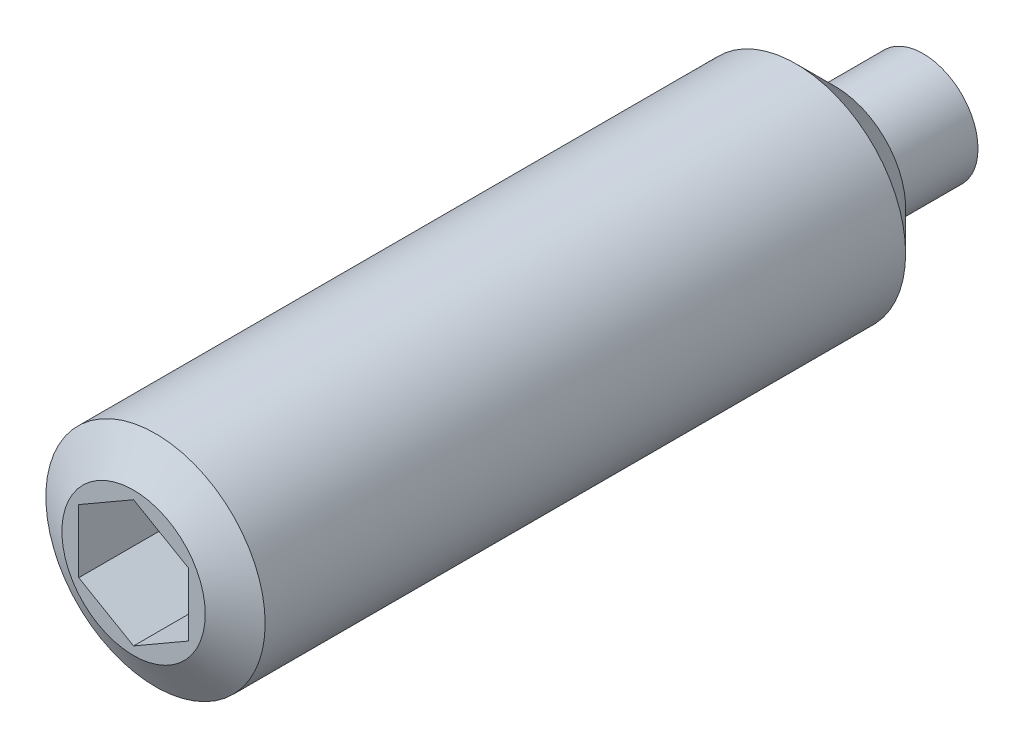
ISO-10303-21;
HEADER;
FILE_DESCRIPTION(('STEP AP214'),'2;1');
FILE_NAME('part.step','',(''),(''),'','','');
FILE_SCHEMA(('AUTOMOTIVE_DESIGN { 1 0 10303 214 1 1 1 1 }'));
ENDSEC;
DATA;
#1=APPLICATION_CONTEXT('core data for automotive mechanical design processes');
#2=APPLICATION_PROTOCOL_DEFINITION('international standard','automotive_design',2000,#1);
#3=PRODUCT_CONTEXT('',#1,'mechanical');
#4=PRODUCT('Part','Part','',(#3));
#5=PRODUCT_RELATED_PRODUCT_CATEGORY('part','',(#4));
#6=PRODUCT_DEFINITION_FORMATION('','',#4);
#7=PRODUCT_DEFINITION_CONTEXT('part definition',#1,'design');
#8=PRODUCT_DEFINITION('design','',#6,#7);
#9=PRODUCT_DEFINITION_SHAPE('','',#8);
#10=(LENGTH_UNIT() NAMED_UNIT(*) SI_UNIT(.MILLI.,.METRE.));
#11=(NAMED_UNIT(*) PLANE_ANGLE_UNIT() SI_UNIT($,.RADIAN.));
#12=(NAMED_UNIT(*) SI_UNIT($,.STERADIAN.) SOLID_ANGLE_UNIT());
#13=UNCERTAINTY_MEASURE_WITH_UNIT(LENGTH_MEASURE(1.E-05),#10,'distance_accuracy_value','');
#14=(GEOMETRIC_REPRESENTATION_CONTEXT(3) GLOBAL_UNCERTAINTY_ASSIGNED_CONTEXT((#13)) GLOBAL_UNIT_ASSIGNED_CONTEXT((#10,
#11,#12)) REPRESENTATION_CONTEXT('',''));
#15=CARTESIAN_POINT('',(0.,0.,0.));
#16=DIRECTION('',(0.,0.,1.));
#17=DIRECTION('',(1.,0.,0.));
#18=AXIS2_PLACEMENT_3D('',#15,#16,#17);
#19=CARTESIAN_POINT('',(0.,0.,38.));
#20=DIRECTION('',(0.,0.,1.));
#21=DIRECTION('',(1.,0.,0.));
#22=AXIS2_PLACEMENT_3D('',#19,#20,#21);
#23=CYLINDRICAL_SURFACE('',#22,2.5);
#24=CARTESIAN_POINT('',(0.,0.,17.5));
#25=DIRECTION('',(0.,0.,1.));
#26=DIRECTION('',(1.,0.,0.));
#27=AXIS2_PLACEMENT_3D('',#24,#25,#26);
#28=CIRCLE('',#27,2.5);
#29=CARTESIAN_POINT('',(2.5,0.,17.5));
#30=VERTEX_POINT('',#29);
#31=EDGE_CURVE('E9',#30,#30,#28,.F.);
#32=ORIENTED_EDGE('',*,*,#31,.T.);
#33=EDGE_LOOP('',(#32));
#34=FACE_BOUND('',#33,.T.);
#35=CARTESIAN_POINT('',(0.,0.,2.9));
#36=DIRECTION('',(0.,0.,-1.));
#37=DIRECTION('',(-1.,0.,0.));
#38=AXIS2_PLACEMENT_3D('',#35,#36,#37);
#39=CIRCLE('',#38,2.5);
#40=CARTESIAN_POINT('',(-2.5,0.,2.9));
#41=VERTEX_POINT('',#40);
#42=EDGE_CURVE('E127',#41,#41,#39,.F.);
#43=ORIENTED_EDGE('',*,*,#42,.T.);
#44=EDGE_LOOP('',(#43));
#45=FACE_BOUND('',#44,.T.);
#46=ADVANCED_FACE('F14',(#34,#45),#23,.T.);
#47=CARTESIAN_POINT('',(2.5,0.,2.));
#48=DIRECTION('',(0.,0.,-1.));
#49=DIRECTION('',(-1.,0.,0.));
#50=AXIS2_PLACEMENT_3D('',#47,#48,#49);
#51=PLANE('',#50);
#52=CARTESIAN_POINT('',(0.,0.,2.));
#53=DIRECTION('',(0.,0.,-1.));
#54=DIRECTION('',(-1.,0.,0.));
#55=AXIS2_PLACEMENT_3D('',#52,#53,#54);
#56=CIRCLE('',#55,1.6);
#57=CARTESIAN_POINT('',(-1.6,0.,2.));
#58=VERTEX_POINT('',#57);
#59=EDGE_CURVE('E130',#58,#58,#56,.T.);
#60=ORIENTED_EDGE('',*,*,#59,.T.);
#61=EDGE_LOOP('',(#60));
#62=FACE_BOUND('',#61,.T.);
#63=CARTESIAN_POINT('',(0.,0.,2.));
#64=DIRECTION('',(0.,0.,1.));
#65=DIRECTION('',(1.,0.,0.));
#66=AXIS2_PLACEMENT_3D('',#63,#64,#65);
#67=CIRCLE('',#66,1.25);
#68=CARTESIAN_POINT('',(1.25,0.,2.));
#69=VERTEX_POINT('',#68);
#70=EDGE_CURVE('E124',#69,#69,#67,.T.);
#71=ORIENTED_EDGE('',*,*,#70,.T.);
#72=EDGE_LOOP('',(#71));
#73=FACE_BOUND('',#72,.T.);
#74=ADVANCED_FACE('F146',(#62,#73),#51,.T.);
#75=CARTESIAN_POINT('',(0.,0.,38.));
#76=DIRECTION('',(0.,0.,1.));
#77=DIRECTION('',(1.,0.,0.));
#78=AXIS2_PLACEMENT_3D('',#75,#76,#77);
#79=CYLINDRICAL_SURFACE('',#78,1.25);
#80=ORIENTED_EDGE('',*,*,#70,.F.);
#81=EDGE_LOOP('',(#80));
#82=FACE_BOUND('',#81,.T.);
#83=CARTESIAN_POINT('',(0.,0.,0.));
#84=DIRECTION('',(0.,0.,1.));
#85=DIRECTION('',(1.,0.,0.));
#86=AXIS2_PLACEMENT_3D('',#83,#84,#85);
#87=CIRCLE('',#86,1.25);
#88=CARTESIAN_POINT('',(1.25,0.,0.));
#89=VERTEX_POINT('',#88);
#90=EDGE_CURVE('E121',#89,#89,#87,.T.);
#91=ORIENTED_EDGE('',*,*,#90,.T.);
#92=EDGE_LOOP('',(#91));
#93=FACE_BOUND('',#92,.T.);
#94=ADVANCED_FACE('F153',(#82,#93),#79,.T.);
#95=CARTESIAN_POINT('',(1.25,0.,0.));
#96=DIRECTION('',(0.,0.,-1.));
#97=DIRECTION('',(-1.,0.,0.));
#98=AXIS2_PLACEMENT_3D('',#95,#96,#97);
#99=PLANE('',#98);
#100=ORIENTED_EDGE('',*,*,#90,.F.);
#101=EDGE_LOOP('',(#100));
#102=FACE_BOUND('',#101,.T.);
#103=ADVANCED_FACE('F160',(#102),#99,.T.);
#104=CARTESIAN_POINT('',(0.,0.,2.9));
#105=DIRECTION('',(0.,0.,1.));
#106=DIRECTION('',(1.,0.,0.));
#107=AXIS2_PLACEMENT_3D('',#104,#105,#106);
#108=CONICAL_SURFACE('',#107,2.5,0.785398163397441);
#109=ORIENTED_EDGE('',*,*,#59,.F.);
#110=EDGE_LOOP('',(#109));
#111=FACE_BOUND('',#110,.T.);
#112=ORIENTED_EDGE('',*,*,#42,.F.);
#113=EDGE_LOOP('',(#112));
#114=FACE_BOUND('',#113,.T.);
#115=ADVANCED_FACE('F164',(#111,#114),#108,.T.);
#116=CARTESIAN_POINT('',(1.25,-2.16506350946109,15.5));
#117=DIRECTION('',(0.,0.,-1.));
#118=DIRECTION('',(-1.,0.,0.));
#119=AXIS2_PLACEMENT_3D('',#116,#117,#118);
#120=PLANE('',#119);
#121=DIRECTION('',(0.86602540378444,-0.5,0.));
#122=VECTOR('',#121,1.);
#123=CARTESIAN_POINT('',(-1.25,-0.721687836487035,15.5));
#124=LINE('',#123,#122);
#125=CARTESIAN_POINT('',(-1.25,-0.721687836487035,15.5));
#126=VERTEX_POINT('',#125);
#127=CARTESIAN_POINT('',(0.,-1.44337567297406,15.5));
#128=VERTEX_POINT('',#127);
#129=EDGE_CURVE('E99',#126,#128,#124,.T.);
#130=ORIENTED_EDGE('',*,*,#129,.T.);
#131=DIRECTION('',(-0.866025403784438,-0.5,0.));
#132=VECTOR('',#131,1.);
#133=CARTESIAN_POINT('',(1.25,-0.721687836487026,15.5));
#134=LINE('',#133,#132);
#135=CARTESIAN_POINT('',(1.25,-0.721687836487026,15.5));
#136=VERTEX_POINT('',#135);
#137=EDGE_CURVE('E102',#136,#128,#134,.T.);
#138=ORIENTED_EDGE('',*,*,#137,.F.);
#139=DIRECTION('',(0.,-1.,0.));
#140=VECTOR('',#139,1.);
#141=CARTESIAN_POINT('',(1.25,0.721687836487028,15.5));
#142=LINE('',#141,#140);
#143=CARTESIAN_POINT('',(1.25,0.721687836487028,15.5));
#144=VERTEX_POINT('',#143);
#145=EDGE_CURVE('E75',#144,#136,#142,.T.);
#146=ORIENTED_EDGE('',*,*,#145,.F.);
#147=DIRECTION('',(-0.866025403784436,0.5,0.));
#148=VECTOR('',#147,1.);
#149=CARTESIAN_POINT('',(1.25,0.721687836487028,15.5));
#150=LINE('',#149,#148);
#151=CARTESIAN_POINT('',(0.,1.44337567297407,15.5));
#152=VERTEX_POINT('',#151);
#153=EDGE_CURVE('E105',#144,#152,#150,.T.);
#154=ORIENTED_EDGE('',*,*,#153,.T.);
#155=DIRECTION('',(0.866025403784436,0.5,0.));
#156=VECTOR('',#155,1.);
#157=CARTESIAN_POINT('',(-1.25,0.721687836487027,15.5));
#158=LINE('',#157,#156);
#159=CARTESIAN_POINT('',(-1.25,0.721687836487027,15.5));
#160=VERTEX_POINT('',#159);
#161=EDGE_CURVE('E108',#160,#152,#158,.T.);
#162=ORIENTED_EDGE('',*,*,#161,.F.);
#163=DIRECTION('',(0.,-1.,0.));
#164=VECTOR('',#163,1.);
#165=CARTESIAN_POINT('',(-1.25,0.721687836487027,15.5));
#166=LINE('',#165,#164);
#167=EDGE_CURVE('E111',#160,#126,#166,.T.);
#168=ORIENTED_EDGE('',*,*,#167,.T.);
#169=EDGE_LOOP('',(#130,#138,#146,#154,#162,#168));
#170=FACE_BOUND('',#169,.T.);
#171=ADVANCED_FACE('F181',(#170),#120,.F.);
#172=CARTESIAN_POINT('',(1.25,-0.721687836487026,15.5));
#173=DIRECTION('',(-0.5,0.866025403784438,0.));
#174=DIRECTION('',(0.866025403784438,0.5,0.));
#175=AXIS2_PLACEMENT_3D('',#172,#173,#174);
#176=PLANE('',#175);
#177=ORIENTED_EDGE('',*,*,#137,.T.);
#178=DIRECTION('',(0.,0.,1.));
#179=VECTOR('',#178,1.);
#180=CARTESIAN_POINT('',(0.,-1.44337567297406,15.5));
#181=LINE('',#180,#179);
#182=CARTESIAN_POINT('',(0.,-1.44337567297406,18.));
#183=VERTEX_POINT('',#182);
#184=EDGE_CURVE('E80',#128,#183,#181,.T.);
#185=ORIENTED_EDGE('',*,*,#184,.T.);
#186=DIRECTION('',(-0.866025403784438,-0.5,0.));
#187=VECTOR('',#186,1.);
#188=CARTESIAN_POINT('',(1.25,-0.721687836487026,18.));
#189=LINE('',#188,#187);
#190=CARTESIAN_POINT('',(1.25,-0.721687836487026,18.));
#191=VERTEX_POINT('',#190);
#192=EDGE_CURVE('E83',#191,#183,#189,.T.);
#193=ORIENTED_EDGE('',*,*,#192,.F.);
#194=DIRECTION('',(0.,0.,1.));
#195=VECTOR('',#194,1.);
#196=CARTESIAN_POINT('',(1.25,-0.721687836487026,15.5));
#197=LINE('',#196,#195);
#198=EDGE_CURVE('E68',#136,#191,#197,.T.);
#199=ORIENTED_EDGE('',*,*,#198,.F.);
#200=EDGE_LOOP('',(#177,#185,#193,#199));
#201=FACE_BOUND('',#200,.T.);
#202=ADVANCED_FACE('F84',(#201),#176,.T.);
#203=CARTESIAN_POINT('',(1.25,0.721687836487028,15.5));
#204=DIRECTION('',(-1.,0.,0.));
#205=DIRECTION('',(0.,1.,0.));
#206=AXIS2_PLACEMENT_3D('',#203,#204,#205);
#207=PLANE('',#206);
#208=ORIENTED_EDGE('',*,*,#198,.T.);
#209=DIRECTION('',(0.,-1.,0.));
#210=VECTOR('',#209,1.);
#211=CARTESIAN_POINT('',(1.25,0.721687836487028,18.));
#212=LINE('',#211,#210);
#213=CARTESIAN_POINT('',(1.25,0.721687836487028,18.));
#214=VERTEX_POINT('',#213);
#215=EDGE_CURVE('E72',#214,#191,#212,.T.);
#216=ORIENTED_EDGE('',*,*,#215,.F.);
#217=DIRECTION('',(0.,0.,1.));
#218=VECTOR('',#217,1.);
#219=CARTESIAN_POINT('',(1.25,0.721687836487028,15.5));
#220=LINE('',#219,#218);
#221=EDGE_CURVE('E79',#144,#214,#220,.T.);
#222=ORIENTED_EDGE('',*,*,#221,.F.);
#223=ORIENTED_EDGE('',*,*,#145,.T.);
#224=EDGE_LOOP('',(#208,#216,#222,#223));
#225=FACE_BOUND('',#224,.T.);
#226=ADVANCED_FACE('F70',(#225),#207,.T.);
#227=CARTESIAN_POINT('',(1.25,0.721687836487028,15.5));
#228=DIRECTION('',(0.5,0.866025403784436,0.));
#229=DIRECTION('',(0.866025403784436,-0.5,0.));
#230=AXIS2_PLACEMENT_3D('',#227,#228,#229);
#231=PLANE('',#230);
#232=ORIENTED_EDGE('',*,*,#221,.T.);
#233=DIRECTION('',(-0.866025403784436,0.5,0.));
#234=VECTOR('',#233,1.);
#235=CARTESIAN_POINT('',(1.25,0.721687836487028,18.));
#236=LINE('',#235,#234);
#237=CARTESIAN_POINT('',(0.,1.44337567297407,18.));
#238=VERTEX_POINT('',#237);
#239=EDGE_CURVE('E90',#214,#238,#236,.T.);
#240=ORIENTED_EDGE('',*,*,#239,.T.);
#241=DIRECTION('',(0.,0.,1.));
#242=VECTOR('',#241,1.);
#243=CARTESIAN_POINT('',(0.,1.44337567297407,15.5));
#244=LINE('',#243,#242);
#245=EDGE_CURVE('E116',#152,#238,#244,.T.);
#246=ORIENTED_EDGE('',*,*,#245,.F.);
#247=ORIENTED_EDGE('',*,*,#153,.F.);
#248=EDGE_LOOP('',(#232,#240,#246,#247));
#249=FACE_BOUND('',#248,.T.);
#250=ADVANCED_FACE('F172',(#249),#231,.F.);
#251=CARTESIAN_POINT('',(-1.25,0.721687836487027,15.5));
#252=DIRECTION('',(0.5,-0.866025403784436,0.));
#253=DIRECTION('',(-0.866025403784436,-0.5,0.));
#254=AXIS2_PLACEMENT_3D('',#251,#252,#253);
#255=PLANE('',#254);
#256=ORIENTED_EDGE('',*,*,#245,.T.);
#257=DIRECTION('',(0.866025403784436,0.5,0.));
#258=VECTOR('',#257,1.);
#259=CARTESIAN_POINT('',(-1.25,0.721687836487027,18.));
#260=LINE('',#259,#258);
#261=CARTESIAN_POINT('',(-1.25,0.721687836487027,18.));
#262=VERTEX_POINT('',#261);
#263=EDGE_CURVE('E92',#262,#238,#260,.T.);
#264=ORIENTED_EDGE('',*,*,#263,.F.);
#265=DIRECTION('',(0.,0.,1.));
#266=VECTOR('',#265,1.);
#267=CARTESIAN_POINT('',(-1.25,0.721687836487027,15.5));
#268=LINE('',#267,#266);
#269=EDGE_CURVE('E118',#160,#262,#268,.T.);
#270=ORIENTED_EDGE('',*,*,#269,.F.);
#271=ORIENTED_EDGE('',*,*,#161,.T.);
#272=EDGE_LOOP('',(#256,#264,#270,#271));
#273=FACE_BOUND('',#272,.T.);
#274=ADVANCED_FACE('F169',(#273),#255,.T.);
#275=CARTESIAN_POINT('',(-1.25,0.721687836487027,15.5));
#276=DIRECTION('',(-1.,0.,0.));
#277=DIRECTION('',(0.,1.,0.));
#278=AXIS2_PLACEMENT_3D('',#275,#276,#277);
#279=PLANE('',#278);
#280=ORIENTED_EDGE('',*,*,#269,.T.);
#281=DIRECTION('',(0.,-1.,0.));
#282=VECTOR('',#281,1.);
#283=CARTESIAN_POINT('',(-1.25,0.721687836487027,18.));
#284=LINE('',#283,#282);
#285=CARTESIAN_POINT('',(-1.25,-0.721687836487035,18.));
#286=VERTEX_POINT('',#285);
#287=EDGE_CURVE('E97',#262,#286,#284,.T.);
#288=ORIENTED_EDGE('',*,*,#287,.T.);
#289=DIRECTION('',(0.,0.,1.));
#290=VECTOR('',#289,1.);
#291=CARTESIAN_POINT('',(-1.25,-0.721687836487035,15.5));
#292=LINE('',#291,#290);
#293=EDGE_CURVE('E36',#126,#286,#292,.T.);
#294=ORIENTED_EDGE('',*,*,#293,.F.);
#295=ORIENTED_EDGE('',*,*,#167,.F.);
#296=EDGE_LOOP('',(#280,#288,#294,#295));
#297=FACE_BOUND('',#296,.T.);
#298=ADVANCED_FACE('F166',(#297),#279,.F.);
#299=CARTESIAN_POINT('',(-1.25,-0.721687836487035,15.5));
#300=DIRECTION('',(-0.5,-0.86602540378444,0.));
#301=DIRECTION('',(-0.86602540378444,0.5,0.));
#302=AXIS2_PLACEMENT_3D('',#299,#300,#301);
#303=PLANE('',#302);
#304=ORIENTED_EDGE('',*,*,#293,.T.);
#305=DIRECTION('',(0.86602540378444,-0.5,0.));
#306=VECTOR('',#305,1.);
#307=CARTESIAN_POINT('',(-1.25,-0.721687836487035,18.));
#308=LINE('',#307,#306);
#309=EDGE_CURVE('E29',#286,#183,#308,.T.);
#310=ORIENTED_EDGE('',*,*,#309,.T.);
#311=ORIENTED_EDGE('',*,*,#184,.F.);
#312=ORIENTED_EDGE('',*,*,#129,.F.);
#313=EDGE_LOOP('',(#304,#310,#311,#312));
#314=FACE_BOUND('',#313,.T.);
#315=ADVANCED_FACE('F143',(#314),#303,.F.);
#316=CARTESIAN_POINT('',(0.,0.,18.));
#317=DIRECTION('',(0.,0.,1.));
#318=DIRECTION('',(1.,0.,0.));
#319=AXIS2_PLACEMENT_3D('',#316,#317,#318);
#320=PLANE('',#319);
#321=CARTESIAN_POINT('',(0.,0.,18.));
#322=DIRECTION('',(0.,0.,1.));
#323=DIRECTION('',(1.,0.,0.));
#324=AXIS2_PLACEMENT_3D('',#321,#322,#323);
#325=CIRCLE('',#324,1.63397459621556);
#326=CARTESIAN_POINT('',(1.63397459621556,0.,18.));
#327=VERTEX_POINT('',#326);
#328=EDGE_CURVE('E22',#327,#327,#325,.T.);
#329=ORIENTED_EDGE('',*,*,#328,.T.);
#330=EDGE_LOOP('',(#329));
#331=FACE_BOUND('',#330,.T.);
#332=ORIENTED_EDGE('',*,*,#309,.F.);
#333=ORIENTED_EDGE('',*,*,#287,.F.);
#334=ORIENTED_EDGE('',*,*,#263,.T.);
#335=ORIENTED_EDGE('',*,*,#239,.F.);
#336=ORIENTED_EDGE('',*,*,#215,.T.);
#337=ORIENTED_EDGE('',*,*,#192,.T.);
#338=EDGE_LOOP('',(#332,#333,#334,#335,#336,#337));
#339=FACE_BOUND('',#338,.T.);
#340=ADVANCED_FACE('F87',(#331,#339),#320,.T.);
#341=CARTESIAN_POINT('',(0.,0.,18.));
#342=DIRECTION('',(0.,0.,-1.));
#343=DIRECTION('',(-1.,0.,0.));
#344=AXIS2_PLACEMENT_3D('',#341,#342,#343);
#345=CONICAL_SURFACE('',#344,1.63397459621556,1.0471975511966);
#346=ORIENTED_EDGE('',*,*,#31,.F.);
#347=EDGE_LOOP('',(#346));
#348=FACE_BOUND('',#347,.T.);
#349=ORIENTED_EDGE('',*,*,#328,.F.);
#350=EDGE_LOOP('',(#349));
#351=FACE_BOUND('',#350,.T.);
#352=ADVANCED_FACE('F16',(#348,#351),#345,.T.);
#353=CLOSED_SHELL('',(#46,#74,#94,#103,#115,#171,#202,#226,#250,#274,#298,#315,#340,#352));
#354=MANIFOLD_SOLID_BREP('B1',#353);
#355=ADVANCED_BREP_SHAPE_REPRESENTATION('',(#18,#354),#14);
#356=SHAPE_DEFINITION_REPRESENTATION(#9,#355);
ENDSEC;
END-ISO-10303-21;
